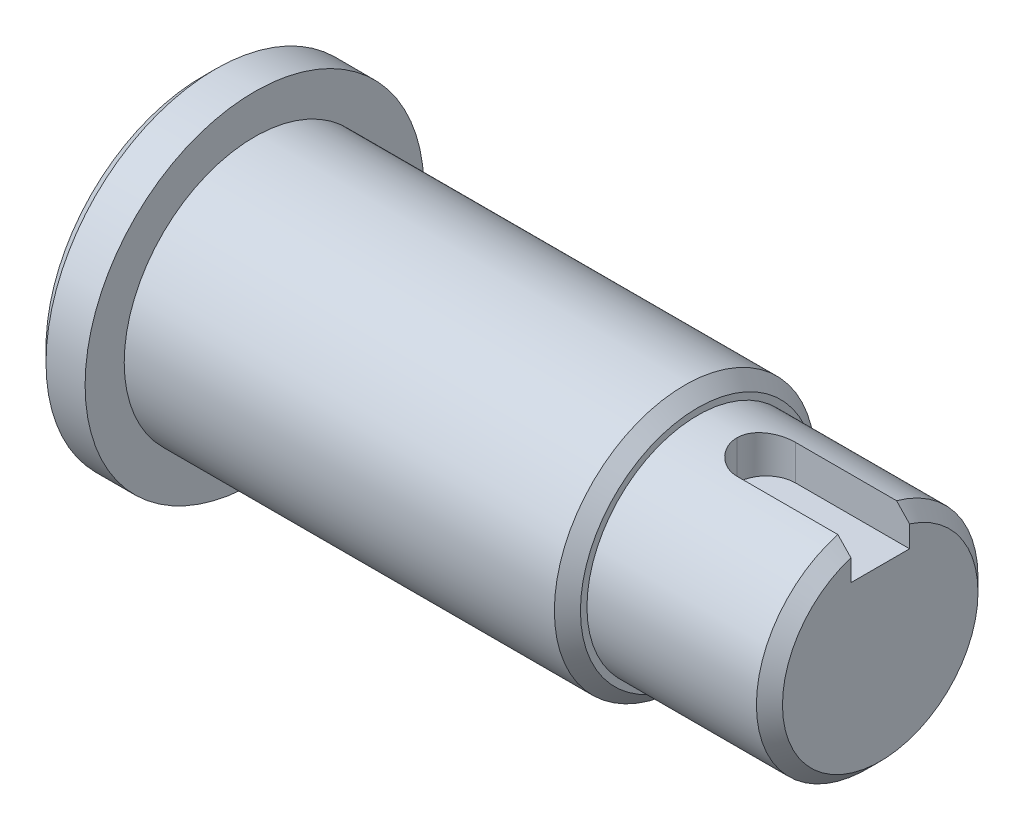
ISO-10303-21;
HEADER;
FILE_DESCRIPTION(('STEP AP214'),'2;1');
FILE_NAME('part.step','',(''),(''),'','','');
FILE_SCHEMA(('AUTOMOTIVE_DESIGN { 1 0 10303 214 1 1 1 1 }'));
ENDSEC;
DATA;
#1=APPLICATION_CONTEXT('core data for automotive mechanical design processes');
#2=APPLICATION_PROTOCOL_DEFINITION('international standard','automotive_design',2000,#1);
#3=PRODUCT_CONTEXT('',#1,'mechanical');
#4=PRODUCT('Part','Part','',(#3));
#5=PRODUCT_RELATED_PRODUCT_CATEGORY('part','',(#4));
#6=PRODUCT_DEFINITION_FORMATION('','',#4);
#7=PRODUCT_DEFINITION_CONTEXT('part definition',#1,'design');
#8=PRODUCT_DEFINITION('design','',#6,#7);
#9=PRODUCT_DEFINITION_SHAPE('','',#8);
#10=(LENGTH_UNIT() NAMED_UNIT(*) SI_UNIT(.MILLI.,.METRE.));
#11=(NAMED_UNIT(*) PLANE_ANGLE_UNIT() SI_UNIT($,.RADIAN.));
#12=(NAMED_UNIT(*) SI_UNIT($,.STERADIAN.) SOLID_ANGLE_UNIT());
#13=UNCERTAINTY_MEASURE_WITH_UNIT(LENGTH_MEASURE(1.E-05),#10,'distance_accuracy_value','');
#14=(GEOMETRIC_REPRESENTATION_CONTEXT(3) GLOBAL_UNCERTAINTY_ASSIGNED_CONTEXT((#13)) GLOBAL_UNIT_ASSIGNED_CONTEXT((#10,
#11,#12)) REPRESENTATION_CONTEXT('',''));
#15=CARTESIAN_POINT('',(0.,0.,0.));
#16=DIRECTION('',(0.,0.,1.));
#17=DIRECTION('',(1.,0.,0.));
#18=AXIS2_PLACEMENT_3D('',#15,#16,#17);
#19=CARTESIAN_POINT('',(0.,0.,0.));
#20=DIRECTION('',(1.,0.,0.));
#21=DIRECTION('',(0.,0.,-1.));
#22=AXIS2_PLACEMENT_3D('',#19,#20,#21);
#23=PLANE('',#22);
#24=CARTESIAN_POINT('',(0.,0.,0.));
#25=DIRECTION('',(1.,0.,0.));
#26=DIRECTION('',(0.,0.,-1.));
#27=AXIS2_PLACEMENT_3D('',#24,#25,#26);
#28=CIRCLE('',#27,12.);
#29=CARTESIAN_POINT('',(0.,0.,-12.));
#30=VERTEX_POINT('',#29);
#31=EDGE_CURVE('E130',#30,#30,#28,.F.);
#32=ORIENTED_EDGE('',*,*,#31,.T.);
#33=EDGE_LOOP('',(#32));
#34=FACE_BOUND('',#33,.T.);
#35=ADVANCED_FACE('F36',(#34),#23,.F.);
#36=CARTESIAN_POINT('',(0.,0.,0.));
#37=DIRECTION('',(-1.,0.,0.));
#38=DIRECTION('',(0.,0.,1.));
#39=AXIS2_PLACEMENT_3D('',#36,#37,#38);
#40=CYLINDRICAL_SURFACE('',#39,13.);
#41=CARTESIAN_POINT('',(1.,0.,0.));
#42=DIRECTION('',(1.,0.,0.));
#43=DIRECTION('',(0.,0.,-1.));
#44=AXIS2_PLACEMENT_3D('',#41,#42,#43);
#45=CIRCLE('',#44,13.);
#46=CARTESIAN_POINT('',(1.,0.,-13.));
#47=VERTEX_POINT('',#46);
#48=EDGE_CURVE('E133',#47,#47,#45,.T.);
#49=ORIENTED_EDGE('',*,*,#48,.T.);
#50=EDGE_LOOP('',(#49));
#51=FACE_BOUND('',#50,.T.);
#52=CARTESIAN_POINT('',(4.,0.,0.));
#53=DIRECTION('',(-1.,0.,0.));
#54=DIRECTION('',(0.,0.,1.));
#55=AXIS2_PLACEMENT_3D('',#52,#53,#54);
#56=CIRCLE('',#55,13.);
#57=CARTESIAN_POINT('',(4.,0.,13.));
#58=VERTEX_POINT('',#57);
#59=EDGE_CURVE('E127',#58,#58,#56,.T.);
#60=ORIENTED_EDGE('',*,*,#59,.T.);
#61=EDGE_LOOP('',(#60));
#62=FACE_BOUND('',#61,.T.);
#63=ADVANCED_FACE('F175',(#51,#62),#40,.T.);
#64=CARTESIAN_POINT('',(4.,10.,0.));
#65=DIRECTION('',(-1.,0.,0.));
#66=DIRECTION('',(0.,0.,1.));
#67=AXIS2_PLACEMENT_3D('',#64,#65,#66);
#68=PLANE('',#67);
#69=ORIENTED_EDGE('',*,*,#59,.F.);
#70=EDGE_LOOP('',(#69));
#71=FACE_BOUND('',#70,.T.);
#72=CARTESIAN_POINT('',(4.,0.,0.));
#73=DIRECTION('',(-1.,0.,0.));
#74=DIRECTION('',(0.,0.,1.));
#75=AXIS2_PLACEMENT_3D('',#72,#73,#74);
#76=CIRCLE('',#75,10.);
#77=CARTESIAN_POINT('',(4.,0.,10.));
#78=VERTEX_POINT('',#77);
#79=EDGE_CURVE('E124',#78,#78,#76,.T.);
#80=ORIENTED_EDGE('',*,*,#79,.T.);
#81=EDGE_LOOP('',(#80));
#82=FACE_BOUND('',#81,.T.);
#83=ADVANCED_FACE('F180',(#71,#82),#68,.F.);
#84=CARTESIAN_POINT('',(0.,0.,0.));
#85=DIRECTION('',(-1.,0.,0.));
#86=DIRECTION('',(0.,0.,1.));
#87=AXIS2_PLACEMENT_3D('',#84,#85,#86);
#88=CYLINDRICAL_SURFACE('',#87,10.);
#89=CARTESIAN_POINT('',(37.,0.,0.));
#90=DIRECTION('',(-1.,0.,0.));
#91=DIRECTION('',(0.,0.,1.));
#92=AXIS2_PLACEMENT_3D('',#89,#90,#91);
#93=CIRCLE('',#92,10.);
#94=CARTESIAN_POINT('',(37.,0.,10.));
#95=VERTEX_POINT('',#94);
#96=EDGE_CURVE('E43',#95,#95,#93,.T.);
#97=ORIENTED_EDGE('',*,*,#96,.T.);
#98=EDGE_LOOP('',(#97));
#99=FACE_BOUND('',#98,.T.);
#100=ORIENTED_EDGE('',*,*,#79,.F.);
#101=EDGE_LOOP('',(#100));
#102=FACE_BOUND('',#101,.T.);
#103=ADVANCED_FACE('F211',(#99,#102),#88,.T.);
#104=CARTESIAN_POINT('',(38.,10.,0.));
#105=DIRECTION('',(-1.,0.,0.));
#106=DIRECTION('',(0.,0.,1.));
#107=AXIS2_PLACEMENT_3D('',#104,#105,#106);
#108=PLANE('',#107);
#109=CARTESIAN_POINT('',(38.,0.,0.));
#110=DIRECTION('',(-1.,0.,0.));
#111=DIRECTION('',(0.,0.,1.));
#112=AXIS2_PLACEMENT_3D('',#109,#110,#111);
#113=CIRCLE('',#112,8.99999999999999);
#114=CARTESIAN_POINT('',(38.,0.,8.99999999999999));
#115=VERTEX_POINT('',#114);
#116=EDGE_CURVE('E11',#115,#115,#113,.F.);
#117=ORIENTED_EDGE('',*,*,#116,.T.);
#118=EDGE_LOOP('',(#117));
#119=FACE_BOUND('',#118,.T.);
#120=CARTESIAN_POINT('',(38.,0.,0.));
#121=DIRECTION('',(-1.,0.,0.));
#122=DIRECTION('',(0.,0.,1.));
#123=AXIS2_PLACEMENT_3D('',#120,#121,#122);
#124=CIRCLE('',#123,8.5);
#125=CARTESIAN_POINT('',(38.,0.,8.5));
#126=VERTEX_POINT('',#125);
#127=EDGE_CURVE('E121',#126,#126,#124,.T.);
#128=ORIENTED_EDGE('',*,*,#127,.T.);
#129=EDGE_LOOP('',(#128));
#130=FACE_BOUND('',#129,.T.);
#131=ADVANCED_FACE('F196',(#119,#130),#108,.F.);
#132=CARTESIAN_POINT('',(0.,0.,0.));
#133=DIRECTION('',(-1.,0.,0.));
#134=DIRECTION('',(0.,0.,1.));
#135=AXIS2_PLACEMENT_3D('',#132,#133,#134);
#136=CYLINDRICAL_SURFACE('',#135,8.5);
#137=CARTESIAN_POINT('',(51.,0.,0.));
#138=DIRECTION('',(-1.,0.,0.));
#139=DIRECTION('',(0.,0.,1.));
#140=AXIS2_PLACEMENT_3D('',#137,#138,#139);
#141=CIRCLE('',#140,8.5);
#142=CARTESIAN_POINT('',(51.,8.19679815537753,-2.25));
#143=VERTEX_POINT('',#142);
#144=CARTESIAN_POINT('',(51.,8.19679815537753,2.25));
#145=VERTEX_POINT('',#144);
#146=EDGE_CURVE('E136',#143,#145,#141,.T.);
#147=ORIENTED_EDGE('',*,*,#146,.T.);
#148=DIRECTION('',(-1.,0.,0.));
#149=VECTOR('',#148,1.);
#150=CARTESIAN_POINT('',(0.,8.1967981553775,2.25));
#151=LINE('',#150,#149);
#152=CARTESIAN_POINT('',(43.25,8.19679815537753,2.25));
#153=VERTEX_POINT('',#152);
#154=EDGE_CURVE('E119',#145,#153,#151,.T.);
#155=ORIENTED_EDGE('',*,*,#154,.T.);
#156=CARTESIAN_POINT('',(43.25,8.19679815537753,2.25));
#157=CARTESIAN_POINT('',(43.1879035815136,8.19679073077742,2.25000734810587));
#158=CARTESIAN_POINT('',(43.1258116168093,8.19750362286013,2.24742947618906));
#159=CARTESIAN_POINT('',(43.0020946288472,8.20031494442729,2.23716038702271));
#160=CARTESIAN_POINT('',(42.9404695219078,8.20241311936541,2.22947010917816));
#161=CARTESIAN_POINT('',(42.8182553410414,8.20793388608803,2.2090556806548));
#162=CARTESIAN_POINT('',(42.7576642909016,8.21135356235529,2.19634260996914));
#163=CARTESIAN_POINT('',(42.6378244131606,8.21940859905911,2.16600249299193));
#164=CARTESIAN_POINT('',(42.5785756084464,8.2240439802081,2.14837536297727));
#165=CARTESIAN_POINT('',(42.4034772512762,8.23957793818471,2.08832189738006));
#166=CARTESIAN_POINT('',(42.2901462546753,8.25211061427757,2.03870164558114));
#167=CARTESIAN_POINT('',(42.0734313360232,8.28010946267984,1.92181591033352));
#168=CARTESIAN_POINT('',(41.9700509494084,8.29557667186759,1.85454418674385));
#169=CARTESIAN_POINT('',(41.77359576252,8.3281256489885,1.70249439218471));
#170=CARTESIAN_POINT('',(41.6807988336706,8.3452355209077,1.61736265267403));
#171=CARTESIAN_POINT('',(41.5106151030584,8.37890098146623,1.43276165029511));
#172=CARTESIAN_POINT('',(41.4332312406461,8.39545646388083,1.33328965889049));
#173=CARTESIAN_POINT('',(41.2948903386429,8.42646569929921,1.12087766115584));
#174=CARTESIAN_POINT('',(41.2342168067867,8.44088146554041,1.00774715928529));
#175=CARTESIAN_POINT('',(41.132890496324,8.4656498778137,0.772476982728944));
#176=CARTESIAN_POINT('',(41.092221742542,8.47600576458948,0.650344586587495));
#177=CARTESIAN_POINT('',(41.04160087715,8.48905913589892,0.439648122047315));
#178=CARTESIAN_POINT('',(41.0260265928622,8.49313738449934,0.35247924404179));
#179=CARTESIAN_POINT('',(41.0052186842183,8.49861851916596,0.176889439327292));
#180=CARTESIAN_POINT('',(40.999978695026,8.50002305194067,0.088469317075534));
#181=CARTESIAN_POINT('',(41.,8.50000000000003,0.));
#182=B_SPLINE_CURVE_WITH_KNOTS('',3,(#156,#157,#158,#159,#160,#161,#162,#163,#164,#165,#166,
#167,#168,#169,#170,#171,#172,#173,#174,#175,#176,#177,#178,#179,#180,#181),.UNSPECIFIED.,.F.,
.F.,(4,2,2,2,2,2,2,2,2,2,2,2,4),(0.,0.186224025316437,0.37241384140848,0.55819520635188,
0.743979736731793,1.11515931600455,1.48647029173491,1.86597790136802,2.24555781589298,
2.63122844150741,3.01659058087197,3.28190386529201,3.54705369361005),.UNSPECIFIED.);
#183=CARTESIAN_POINT('',(41.,8.50000000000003,0.));
#184=VERTEX_POINT('',#183);
#185=EDGE_CURVE('E50',#153,#184,#182,.T.);
#186=ORIENTED_EDGE('',*,*,#185,.T.);
#187=CARTESIAN_POINT('',(41.,8.50000000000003,0.));
#188=CARTESIAN_POINT('',(40.9999927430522,8.50000646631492,-0.0621350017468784));
#189=CARTESIAN_POINT('',(41.0025737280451,8.49931883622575,-0.124265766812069));
#190=CARTESIAN_POINT('',(41.0128558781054,8.4966033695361,-0.248062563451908));
#191=CARTESIAN_POINT('',(41.0205561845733,8.49457575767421,-0.309728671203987));
#192=CARTESIAN_POINT('',(41.040999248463,8.48923389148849,-0.43203263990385));
#193=CARTESIAN_POINT('',(41.0537313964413,8.48592234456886,-0.492672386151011));
#194=CARTESIAN_POINT('',(41.0841188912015,8.47810872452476,-0.612610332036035));
#195=CARTESIAN_POINT('',(41.1017743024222,8.47360663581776,-0.671908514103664));
#196=CARTESIAN_POINT('',(41.1619303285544,8.45848705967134,-0.847162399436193));
#197=CARTESIAN_POINT('',(41.211641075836,8.44625064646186,-0.960597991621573));
#198=CARTESIAN_POINT('',(41.3287385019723,8.41876029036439,-1.1774866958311));
#199=CARTESIAN_POINT('',(41.3961306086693,8.40350542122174,-1.28093672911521));
#200=CARTESIAN_POINT('',(41.5483049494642,8.37123859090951,-1.47731767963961));
#201=CARTESIAN_POINT('',(41.6334136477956,8.35419715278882,-1.5699912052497));
#202=CARTESIAN_POINT('',(41.8179171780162,8.32046577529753,-1.73993572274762));
#203=CARTESIAN_POINT('',(41.9173152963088,8.30377591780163,-1.8172031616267));
#204=CARTESIAN_POINT('',(42.1296553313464,8.27233190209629,-1.95541549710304));
#205=CARTESIAN_POINT('',(42.2428005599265,8.25761591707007,-2.01605722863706));
#206=CARTESIAN_POINT('',(42.4780989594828,8.23223546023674,-2.1173192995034));
#207=CARTESIAN_POINT('',(42.6002444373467,8.22156757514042,-2.15795651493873));
#208=CARTESIAN_POINT('',(42.8108555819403,8.20810651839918,-2.20849470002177));
#209=CARTESIAN_POINT('',(42.8979189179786,8.20389431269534,-2.22403214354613));
#210=CARTESIAN_POINT('',(43.0733051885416,8.1982276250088,-2.2447927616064));
#211=CARTESIAN_POINT('',(43.1616274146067,8.19677164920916,-2.25002152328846));
#212=CARTESIAN_POINT('',(43.25,8.19679815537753,-2.25));
#213=B_SPLINE_CURVE_WITH_KNOTS('',3,(#187,#188,#189,#190,#191,#192,#193,#194,#195,#196,#197,
#198,#199,#200,#201,#202,#203,#204,#205,#206,#207,#208,#209,#210,#211,#212),.UNSPECIFIED.,.F.,
.F.,(4,2,2,2,2,2,2,2,2,2,2,2,4),(0.,0.186340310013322,0.372649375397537,0.558567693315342,
0.744488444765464,1.11596741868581,1.48756056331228,1.86672790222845,2.24598258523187,
2.63175162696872,3.01719466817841,3.28219577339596,3.5470532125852),.UNSPECIFIED.);
#214=CARTESIAN_POINT('',(43.25,8.19679815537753,-2.25));
#215=VERTEX_POINT('',#214);
#216=EDGE_CURVE('E54',#184,#215,#213,.T.);
#217=ORIENTED_EDGE('',*,*,#216,.T.);
#218=DIRECTION('',(-1.,0.,0.));
#219=VECTOR('',#218,1.);
#220=CARTESIAN_POINT('',(0.,8.1967981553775,-2.25));
#221=LINE('',#220,#219);
#222=EDGE_CURVE('E116',#215,#143,#221,.F.);
#223=ORIENTED_EDGE('',*,*,#222,.T.);
#224=EDGE_LOOP('',(#147,#155,#186,#217,#223));
#225=FACE_BOUND('',#224,.T.);
#226=ORIENTED_EDGE('',*,*,#127,.F.);
#227=EDGE_LOOP('',(#226));
#228=FACE_BOUND('',#227,.T.);
#229=ADVANCED_FACE('F189',(#225,#228),#136,.T.);
#230=CARTESIAN_POINT('',(52.,8.50000000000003,0.));
#231=DIRECTION('',(-1.,0.,0.));
#232=DIRECTION('',(0.,0.,1.));
#233=AXIS2_PLACEMENT_3D('',#230,#231,#232);
#234=PLANE('',#233);
#235=DIRECTION('',(0.,0.,-1.));
#236=VECTOR('',#235,1.);
#237=CARTESIAN_POINT('',(52.,5.50000000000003,2.25));
#238=LINE('',#237,#236);
#239=CARTESIAN_POINT('',(52.,5.50000000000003,2.25));
#240=VERTEX_POINT('',#239);
#241=CARTESIAN_POINT('',(52.,5.50000000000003,-2.25));
#242=VERTEX_POINT('',#241);
#243=EDGE_CURVE('E91',#240,#242,#238,.T.);
#244=ORIENTED_EDGE('',*,*,#243,.F.);
#245=DIRECTION('',(0.,-1.,0.));
#246=VECTOR('',#245,1.);
#247=CARTESIAN_POINT('',(52.,10.,2.25));
#248=LINE('',#247,#246);
#249=CARTESIAN_POINT('',(52.,7.15454401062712,2.25));
#250=VERTEX_POINT('',#249);
#251=EDGE_CURVE('E102',#250,#240,#248,.T.);
#252=ORIENTED_EDGE('',*,*,#251,.F.);
#253=CARTESIAN_POINT('',(52.,0.,0.));
#254=DIRECTION('',(-1.,0.,0.));
#255=DIRECTION('',(0.,0.,1.));
#256=AXIS2_PLACEMENT_3D('',#253,#254,#255);
#257=CIRCLE('',#256,7.5);
#258=CARTESIAN_POINT('',(52.,7.15454401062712,-2.25));
#259=VERTEX_POINT('',#258);
#260=EDGE_CURVE('E139',#250,#259,#257,.F.);
#261=ORIENTED_EDGE('',*,*,#260,.T.);
#262=DIRECTION('',(0.,1.,0.));
#263=VECTOR('',#262,1.);
#264=CARTESIAN_POINT('',(52.,10.,-2.25));
#265=LINE('',#264,#263);
#266=EDGE_CURVE('E99',#242,#259,#265,.T.);
#267=ORIENTED_EDGE('',*,*,#266,.F.);
#268=EDGE_LOOP('',(#244,#252,#261,#267));
#269=FACE_BOUND('',#268,.T.);
#270=ADVANCED_FACE('F111',(#269),#234,.F.);
#271=CARTESIAN_POINT('',(0.,0.,0.));
#272=DIRECTION('',(1.,0.,0.));
#273=DIRECTION('',(0.,0.,-1.));
#274=AXIS2_PLACEMENT_3D('',#271,#272,#273);
#275=CONICAL_SURFACE('',#274,12.,0.785398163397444);
#276=ORIENTED_EDGE('',*,*,#48,.F.);
#277=EDGE_LOOP('',(#276));
#278=FACE_BOUND('',#277,.T.);
#279=ORIENTED_EDGE('',*,*,#31,.F.);
#280=EDGE_LOOP('',(#279));
#281=FACE_BOUND('',#280,.T.);
#282=ADVANCED_FACE('F172',(#278,#281),#275,.T.);
#283=CARTESIAN_POINT('',(51.,0.,0.));
#284=DIRECTION('',(-1.,0.,0.));
#285=DIRECTION('',(0.,0.,1.));
#286=AXIS2_PLACEMENT_3D('',#283,#284,#285);
#287=CONICAL_SURFACE('',#286,8.5,0.785398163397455);
#288=CARTESIAN_POINT('',(47.3429716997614,11.9470011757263,2.25));
#289=CARTESIAN_POINT('',(47.7038567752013,11.5797384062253,2.25));
#290=CARTESIAN_POINT('',(48.0644838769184,11.2122209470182,2.25));
#291=CARTESIAN_POINT('',(48.7849406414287,10.4764395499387,2.25));
#292=CARTESIAN_POINT('',(49.1447703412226,10.108175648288,2.25));
#293=CARTESIAN_POINT('',(49.8632662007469,9.37075150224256,2.25));
#294=CARTESIAN_POINT('',(50.2219327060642,9.00159159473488,2.25));
#295=CARTESIAN_POINT('',(50.9377992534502,8.2618137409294,2.25));
#296=CARTESIAN_POINT('',(51.2949992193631,7.89119572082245,2.25));
#297=CARTESIAN_POINT('',(51.8292186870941,7.33356598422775,2.25));
#298=CARTESIAN_POINT('',(52.0070751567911,7.14735625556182,2.25));
#299=CARTESIAN_POINT('',(52.3620815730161,6.77426630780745,2.25));
#300=CARTESIAN_POINT('',(52.5392315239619,6.5873860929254,2.25));
#301=CARTESIAN_POINT('',(52.8926130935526,6.21280298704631,2.25));
#302=CARTESIAN_POINT('',(53.0688448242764,6.02510020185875,2.25));
#303=CARTESIAN_POINT('',(53.4201474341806,5.64860164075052,2.25));
#304=CARTESIAN_POINT('',(53.5952182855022,5.4598058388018,2.25));
#305=CARTESIAN_POINT('',(53.9438887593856,5.08069070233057,2.25));
#306=CARTESIAN_POINT('',(54.1174876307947,4.89037067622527,2.25));
#307=CARTESIAN_POINT('',(54.4625400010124,4.50781128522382,2.25));
#308=CARTESIAN_POINT('',(54.6339936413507,4.31557204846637,2.25));
#309=CARTESIAN_POINT('',(54.8889073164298,4.02514705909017,2.25));
#310=CARTESIAN_POINT('',(54.9735192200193,3.9279726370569,2.25));
#311=CARTESIAN_POINT('',(55.1417970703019,3.73281091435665,2.25));
#312=CARTESIAN_POINT('',(55.2254630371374,3.63482363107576,2.25));
#313=CARTESIAN_POINT('',(55.3916564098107,3.43784816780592,2.25));
#314=CARTESIAN_POINT('',(55.4741835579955,3.33885976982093,2.25));
#315=CARTESIAN_POINT('',(55.6377690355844,3.13966567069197,2.25));
#316=CARTESIAN_POINT('',(55.7188272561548,3.03945988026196,2.25));
#317=CARTESIAN_POINT('',(55.7989892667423,2.93853372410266,2.25));
#318=B_SPLINE_CURVE_WITH_KNOTS('',3,(#288,#289,#290,#291,#292,#293,#294,#295,#296,#297,#298,
#299,#300,#301,#302,#303,#304,#305,#306,#307,#308,#309,#310,#311,#312,#313,#314,#315,#316,#317),
.UNSPECIFIED.,.F.,.F.,(4,2,2,2,2,2,2,2,2,2,2,2,2,2,4),(0.,1.54469528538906,3.08931732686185,
4.63342830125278,6.17761847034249,6.95012138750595,7.72261946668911,8.49502093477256,
9.26744087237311,10.0402337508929,10.8129753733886,11.1995173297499,11.5860510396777,
11.9726708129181,12.3593191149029),.UNSPECIFIED.);
#319=EDGE_CURVE('E105',#145,#250,#318,.T.);
#320=ORIENTED_EDGE('',*,*,#319,.F.);
#321=ORIENTED_EDGE('',*,*,#146,.F.);
#322=CARTESIAN_POINT('',(55.7989892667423,2.93853372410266,-2.25));
#323=CARTESIAN_POINT('',(55.7426817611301,3.00944349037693,-2.25));
#324=CARTESIAN_POINT('',(55.6859220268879,3.07999131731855,-2.25));
#325=CARTESIAN_POINT('',(55.5716254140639,3.2204508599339,-2.25));
#326=CARTESIAN_POINT('',(55.5140885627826,3.29036259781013,-2.25));
#327=CARTESIAN_POINT('',(55.3405129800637,3.49926387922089,-2.25));
#328=CARTESIAN_POINT('',(55.2234939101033,3.6374386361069,-2.25));
#329=CARTESIAN_POINT('',(54.987571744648,3.9120889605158,-2.25));
#330=CARTESIAN_POINT('',(54.8686692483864,4.04856504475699,-2.25));
#331=CARTESIAN_POINT('',(54.6293961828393,4.3202317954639,-2.25));
#332=CARTESIAN_POINT('',(54.5090255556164,4.45542241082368,-2.25));
#333=CARTESIAN_POINT('',(54.1463479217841,4.85934605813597,-2.25));
#334=CARTESIAN_POINT('',(53.9023576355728,5.12656626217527,-2.25));
#335=CARTESIAN_POINT('',(53.4115209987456,5.65839699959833,-2.25));
#336=CARTESIAN_POINT('',(53.1646744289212,5.92300732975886,-2.25));
#337=CARTESIAN_POINT('',(52.8119610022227,6.29831736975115,-2.25));
#338=CARTESIAN_POINT('',(52.7068920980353,6.40976824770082,-2.25));
#339=CARTESIAN_POINT('',(52.4964538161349,6.63238126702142,-2.25));
#340=CARTESIAN_POINT('',(52.391084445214,6.74354341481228,-2.25));
#341=CARTESIAN_POINT('',(52.0745636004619,7.07668054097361,-2.25));
#342=CARTESIAN_POINT('',(51.8630206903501,7.29828357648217,-2.25));
#343=CARTESIAN_POINT('',(51.2948927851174,7.89130539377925,-2.25));
#344=CARTESIAN_POINT('',(50.9375871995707,8.26203339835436,-2.25));
#345=CARTESIAN_POINT('',(50.2214884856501,9.00205013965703,-2.25));
#346=CARTESIAN_POINT('',(49.8626953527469,9.37133887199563,-2.25));
#347=CARTESIAN_POINT('',(49.1441777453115,10.108782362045,-2.25));
#348=CARTESIAN_POINT('',(48.784453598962,10.4769374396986,-2.25));
#349=CARTESIAN_POINT('',(48.0642295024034,11.2124802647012,-2.25));
#350=CARTESIAN_POINT('',(47.7037295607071,11.5798680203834,-2.25));
#351=CARTESIAN_POINT('',(47.3429716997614,11.9470011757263,-2.25));
#352=B_SPLINE_CURVE_WITH_KNOTS('',3,(#322,#323,#324,#325,#326,#327,#328,#329,#330,#331,#332,
#333,#334,#335,#336,#337,#338,#339,#340,#341,#342,#343,#344,#345,#346,#347,#348,#349,#350,#351),
.UNSPECIFIED.,.F.,.F.,(4,2,2,2,2,2,2,2,2,2,2,2,2,2,4),(0.,0.271635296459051,0.543261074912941,
1.08643910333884,1.62944765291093,2.17247770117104,3.25800006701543,4.34360630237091,
4.80311315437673,5.26260970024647,6.18169600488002,7.72634406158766,9.27099682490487,
10.8151640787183,12.3593144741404),.UNSPECIFIED.);
#353=EDGE_CURVE('E141',#259,#143,#352,.T.);
#354=ORIENTED_EDGE('',*,*,#353,.F.);
#355=ORIENTED_EDGE('',*,*,#260,.F.);
#356=EDGE_LOOP('',(#320,#321,#354,#355));
#357=FACE_BOUND('',#356,.T.);
#358=ADVANCED_FACE('F154',(#357),#287,.T.);
#359=CARTESIAN_POINT('',(41.,10.,2.25));
#360=DIRECTION('',(0.,0.,1.));
#361=DIRECTION('',(0.,-1.,0.));
#362=AXIS2_PLACEMENT_3D('',#359,#360,#361);
#363=PLANE('',#362);
#364=DIRECTION('',(1.,0.,0.));
#365=VECTOR('',#364,1.);
#366=CARTESIAN_POINT('',(41.,5.50000000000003,2.25));
#367=LINE('',#366,#365);
#368=CARTESIAN_POINT('',(43.25,5.50000000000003,2.25));
#369=VERTEX_POINT('',#368);
#370=EDGE_CURVE('E86',#369,#240,#367,.T.);
#371=ORIENTED_EDGE('',*,*,#370,.F.);
#372=DIRECTION('',(0.,-1.,0.));
#373=VECTOR('',#372,1.);
#374=CARTESIAN_POINT('',(43.25,10.,2.25));
#375=LINE('',#374,#373);
#376=EDGE_CURVE('E325',#369,#153,#375,.F.);
#377=ORIENTED_EDGE('',*,*,#376,.T.);
#378=ORIENTED_EDGE('',*,*,#154,.F.);
#379=ORIENTED_EDGE('',*,*,#319,.T.);
#380=ORIENTED_EDGE('',*,*,#251,.T.);
#381=EDGE_LOOP('',(#371,#377,#378,#379,#380));
#382=FACE_BOUND('',#381,.T.);
#383=ADVANCED_FACE('F103',(#382),#363,.F.);
#384=CARTESIAN_POINT('',(41.,10.,-2.25));
#385=DIRECTION('',(0.,0.,-1.));
#386=DIRECTION('',(-1.,0.,0.));
#387=AXIS2_PLACEMENT_3D('',#384,#385,#386);
#388=PLANE('',#387);
#389=ORIENTED_EDGE('',*,*,#222,.F.);
#390=DIRECTION('',(0.,1.,0.));
#391=VECTOR('',#390,1.);
#392=CARTESIAN_POINT('',(43.25,10.,-2.25));
#393=LINE('',#392,#391);
#394=CARTESIAN_POINT('',(43.25,5.50000000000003,-2.25));
#395=VERTEX_POINT('',#394);
#396=EDGE_CURVE('E321',#215,#395,#393,.F.);
#397=ORIENTED_EDGE('',*,*,#396,.T.);
#398=DIRECTION('',(1.,0.,0.));
#399=VECTOR('',#398,1.);
#400=CARTESIAN_POINT('',(41.,5.50000000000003,-2.25));
#401=LINE('',#400,#399);
#402=EDGE_CURVE('E98',#395,#242,#401,.T.);
#403=ORIENTED_EDGE('',*,*,#402,.T.);
#404=ORIENTED_EDGE('',*,*,#266,.T.);
#405=ORIENTED_EDGE('',*,*,#353,.T.);
#406=EDGE_LOOP('',(#389,#397,#403,#404,#405));
#407=FACE_BOUND('',#406,.T.);
#408=ADVANCED_FACE('F157',(#407),#388,.F.);
#409=CARTESIAN_POINT('',(41.,5.50000000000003,2.25));
#410=DIRECTION('',(0.,-1.,0.));
#411=DIRECTION('',(0.,0.,-1.));
#412=AXIS2_PLACEMENT_3D('',#409,#410,#411);
#413=PLANE('',#412);
#414=CARTESIAN_POINT('',(43.25,5.50000000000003,0.));
#415=DIRECTION('',(0.,-1.,0.));
#416=DIRECTION('',(0.,0.,-1.));
#417=AXIS2_PLACEMENT_3D('',#414,#415,#416);
#418=CIRCLE('',#417,2.25);
#419=CARTESIAN_POINT('',(41.,5.50000000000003,0.));
#420=VERTEX_POINT('',#419);
#421=EDGE_CURVE('E324',#395,#420,#418,.F.);
#422=ORIENTED_EDGE('',*,*,#421,.T.);
#423=CARTESIAN_POINT('',(43.25,5.50000000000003,0.));
#424=DIRECTION('',(0.,-1.,0.));
#425=DIRECTION('',(0.,0.,-1.));
#426=AXIS2_PLACEMENT_3D('',#423,#424,#425);
#427=CIRCLE('',#426,2.25);
#428=EDGE_CURVE('E94',#420,#369,#427,.F.);
#429=ORIENTED_EDGE('',*,*,#428,.T.);
#430=ORIENTED_EDGE('',*,*,#370,.T.);
#431=ORIENTED_EDGE('',*,*,#243,.T.);
#432=ORIENTED_EDGE('',*,*,#402,.F.);
#433=EDGE_LOOP('',(#422,#429,#430,#431,#432));
#434=FACE_BOUND('',#433,.T.);
#435=ADVANCED_FACE('F88',(#434),#413,.F.);
#436=CARTESIAN_POINT('',(43.25,5.50000000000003,0.));
#437=DIRECTION('',(0.,1.,0.));
#438=DIRECTION('',(0.,0.,1.));
#439=AXIS2_PLACEMENT_3D('',#436,#437,#438);
#440=CYLINDRICAL_SURFACE('',#439,2.25);
#441=ORIENTED_EDGE('',*,*,#396,.F.);
#442=ORIENTED_EDGE('',*,*,#216,.F.);
#443=DIRECTION('',(0.,1.,0.));
#444=VECTOR('',#443,1.);
#445=CARTESIAN_POINT('',(41.,5.50000000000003,0.));
#446=LINE('',#445,#444);
#447=EDGE_CURVE('E109',#420,#184,#446,.T.);
#448=ORIENTED_EDGE('',*,*,#447,.F.);
#449=ORIENTED_EDGE('',*,*,#421,.F.);
#450=EDGE_LOOP('',(#441,#442,#448,#449));
#451=FACE_BOUND('',#450,.T.);
#452=ADVANCED_FACE('F163',(#451),#440,.F.);
#453=CARTESIAN_POINT('',(43.25,5.50000000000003,0.));
#454=DIRECTION('',(0.,-1.,0.));
#455=DIRECTION('',(0.,0.,-1.));
#456=AXIS2_PLACEMENT_3D('',#453,#454,#455);
#457=CYLINDRICAL_SURFACE('',#456,2.25);
#458=ORIENTED_EDGE('',*,*,#185,.F.);
#459=ORIENTED_EDGE('',*,*,#376,.F.);
#460=ORIENTED_EDGE('',*,*,#428,.F.);
#461=ORIENTED_EDGE('',*,*,#447,.T.);
#462=EDGE_LOOP('',(#458,#459,#460,#461));
#463=FACE_BOUND('',#462,.T.);
#464=ADVANCED_FACE('F216',(#463),#457,.F.);
#465=CARTESIAN_POINT('',(37.,0.,0.));
#466=DIRECTION('',(-1.,0.,0.));
#467=DIRECTION('',(0.,0.,1.));
#468=AXIS2_PLACEMENT_3D('',#465,#466,#467);
#469=CONICAL_SURFACE('',#468,10.,0.785398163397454);
#470=ORIENTED_EDGE('',*,*,#116,.F.);
#471=EDGE_LOOP('',(#470));
#472=FACE_BOUND('',#471,.T.);
#473=ORIENTED_EDGE('',*,*,#96,.F.);
#474=EDGE_LOOP('',(#473));
#475=FACE_BOUND('',#474,.T.);
#476=ADVANCED_FACE('F214',(#472,#475),#469,.T.);
#477=CLOSED_SHELL('',(#35,#63,#83,#103,#131,#229,#270,#282,#358,#383,#408,#435,#452,#464,#476));
#478=MANIFOLD_SOLID_BREP('B2',#477);
#479=ADVANCED_BREP_SHAPE_REPRESENTATION('',(#18,#478),#14);
#480=SHAPE_DEFINITION_REPRESENTATION(#9,#479);
ENDSEC;
END-ISO-10303-21;
